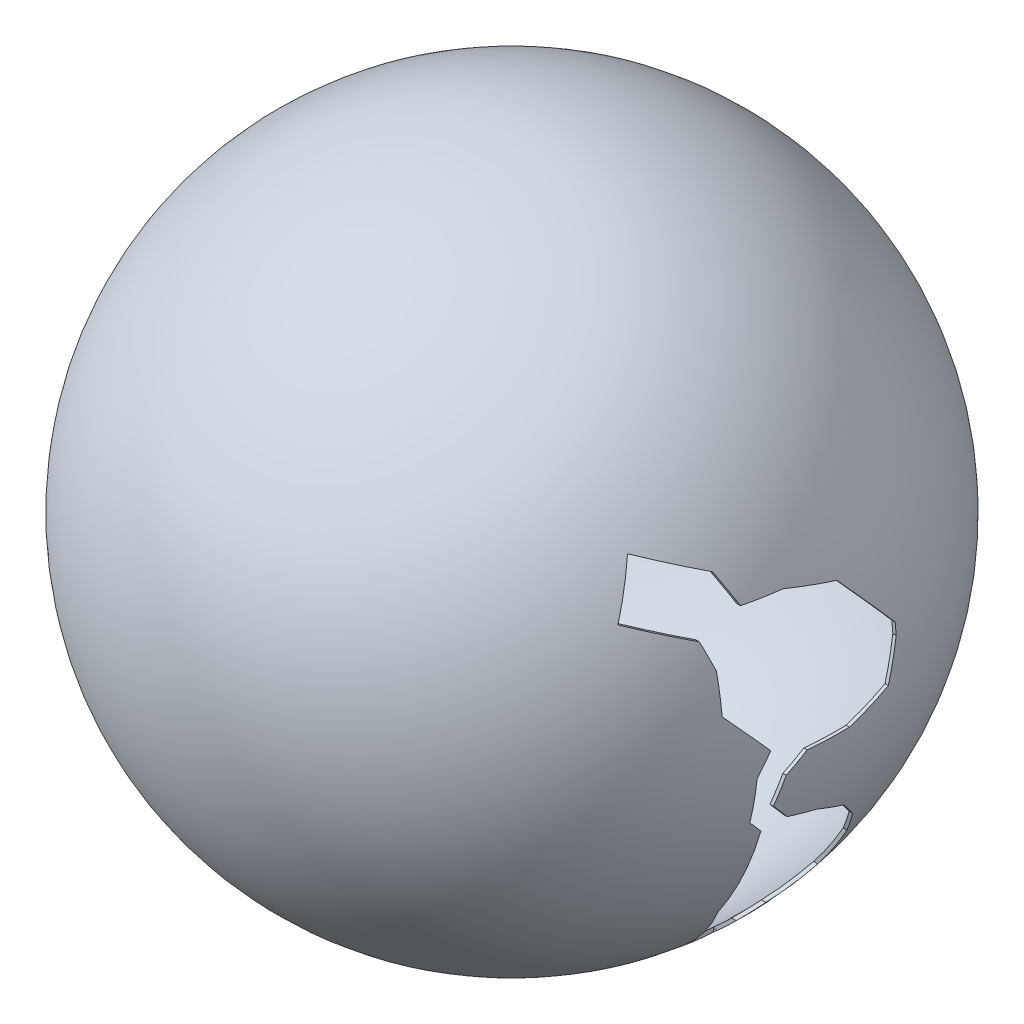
ISO-10303-21;
HEADER;
FILE_DESCRIPTION(('STEP AP214'),'2;1');
FILE_NAME('part.step','',(''),(''),'','','');
FILE_SCHEMA(('AUTOMOTIVE_DESIGN { 1 0 10303 214 1 1 1 1 }'));
ENDSEC;
DATA;
#1=APPLICATION_CONTEXT('core data for automotive mechanical design processes');
#2=APPLICATION_PROTOCOL_DEFINITION('international standard','automotive_design',2000,#1);
#3=PRODUCT_CONTEXT('',#1,'mechanical');
#4=PRODUCT('Part','Part','',(#3));
#5=PRODUCT_RELATED_PRODUCT_CATEGORY('part','',(#4));
#6=PRODUCT_DEFINITION_FORMATION('','',#4);
#7=PRODUCT_DEFINITION_CONTEXT('part definition',#1,'design');
#8=PRODUCT_DEFINITION('design','',#6,#7);
#9=PRODUCT_DEFINITION_SHAPE('','',#8);
#10=(LENGTH_UNIT() NAMED_UNIT(*) SI_UNIT(.MILLI.,.METRE.));
#11=(NAMED_UNIT(*) PLANE_ANGLE_UNIT() SI_UNIT($,.RADIAN.));
#12=(NAMED_UNIT(*) SI_UNIT($,.STERADIAN.) SOLID_ANGLE_UNIT());
#13=UNCERTAINTY_MEASURE_WITH_UNIT(LENGTH_MEASURE(1.E-05),#10,'distance_accuracy_value','');
#14=(GEOMETRIC_REPRESENTATION_CONTEXT(3) GLOBAL_UNCERTAINTY_ASSIGNED_CONTEXT((#13)) GLOBAL_UNIT_ASSIGNED_CONTEXT((#10,
#11,#12)) REPRESENTATION_CONTEXT('',''));
#15=CARTESIAN_POINT('',(0.,0.,0.));
#16=DIRECTION('',(0.,0.,1.));
#17=DIRECTION('',(1.,0.,0.));
#18=AXIS2_PLACEMENT_3D('',#15,#16,#17);
#19=CARTESIAN_POINT('',(0.,0.,0.));
#20=DIRECTION('',(0.,1.,0.));
#21=DIRECTION('',(1.,0.,0.));
#22=AXIS2_PLACEMENT_3D('',#19,#20,#21);
#23=SPHERICAL_SURFACE('',#22,99.);
#24=CARTESIAN_POINT('',(0.,-21.2656708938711,24.1010936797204));
#25=DIRECTION('',(0.,-0.661621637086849,0.749837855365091));
#26=DIRECTION('',(0.,-0.749837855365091,-0.661621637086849));
#27=AXIS2_PLACEMENT_3D('',#24,#25,#26);
#28=CIRCLE('',#27,93.6371108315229);
#29=CARTESIAN_POINT('',(93.6068291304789,-23.051177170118,22.5256469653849));
#30=VERTEX_POINT('',#29);
#31=CARTESIAN_POINT('',(93.3028753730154,-27.1928046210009,18.8712698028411));
#32=VERTEX_POINT('',#31);
#33=EDGE_CURVE('E521',#30,#32,#28,.F.);
#34=ORIENTED_EDGE('',*,*,#33,.T.);
#35=CARTESIAN_POINT('',(0.,0.,18.8712698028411));
#36=DIRECTION('',(0.,0.,1.));
#37=DIRECTION('',(1.,0.,0.));
#38=AXIS2_PLACEMENT_3D('',#35,#36,#37);
#39=CIRCLE('',#38,97.1847476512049);
#40=CARTESIAN_POINT('',(80.0762388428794,-55.0696935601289,18.8712698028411));
#41=VERTEX_POINT('',#40);
#42=EDGE_CURVE('E41',#32,#41,#39,.F.);
#43=ORIENTED_EDGE('',*,*,#42,.T.);
#44=CARTESIAN_POINT('',(0.,-10.6902748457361,33.1729344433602));
#45=DIRECTION('',(0.,-0.306725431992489,0.951798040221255));
#46=DIRECTION('',(0.,-0.951798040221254,-0.306725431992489));
#47=AXIS2_PLACEMENT_3D('',#44,#45,#46);
#48=CIRCLE('',#47,92.6621521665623);
#49=CARTESIAN_POINT('',(64.787557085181,-73.7453461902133,12.8528736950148));
#50=VERTEX_POINT('',#49);
#51=EDGE_CURVE('E439',#41,#50,#48,.F.);
#52=ORIENTED_EDGE('',*,*,#51,.T.);
#53=CARTESIAN_POINT('',(64.787557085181,0.,0.));
#54=DIRECTION('',(-1.,0.,0.));
#55=DIRECTION('',(0.,0.,1.));
#56=AXIS2_PLACEMENT_3D('',#53,#54,#55);
#57=CIRCLE('',#56,74.857013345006);
#58=CARTESIAN_POINT('',(64.787557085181,-74.7767535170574,3.46548414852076));
#59=VERTEX_POINT('',#58);
#60=EDGE_CURVE('E437',#50,#59,#57,.F.);
#61=ORIENTED_EDGE('',*,*,#60,.T.);
#62=CARTESIAN_POINT('',(0.,0.,3.46548414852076));
#63=DIRECTION('',(0.,0.,-1.));
#64=DIRECTION('',(-1.,0.,0.));
#65=AXIS2_PLACEMENT_3D('',#62,#63,#64);
#66=CIRCLE('',#65,98.9393269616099);
#67=CARTESIAN_POINT('',(70.050570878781,-69.870651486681,3.46548414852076));
#68=VERTEX_POINT('',#67);
#69=EDGE_CURVE('E257',#59,#68,#66,.F.);
#70=ORIENTED_EDGE('',*,*,#69,.T.);
#71=CARTESIAN_POINT('',(0.,-37.5659918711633,-33.1464634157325));
#72=DIRECTION('',(0.,-0.749837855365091,-0.661621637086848));
#73=DIRECTION('',(0.,0.661621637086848,-0.749837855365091));
#74=AXIS2_PLACEMENT_3D('',#71,#72,#73);
#75=CIRCLE('',#74,85.3879863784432);
#76=CARTESIAN_POINT('',(74.2174542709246,-65.5023941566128,-1.48520749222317));
#77=VERTEX_POINT('',#76);
#78=EDGE_CURVE('E443',#68,#77,#75,.F.);
#79=ORIENTED_EDGE('',*,*,#78,.T.);
#80=CARTESIAN_POINT('',(0.,-59.7734892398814,-19.2625415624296));
#81=DIRECTION('',(0.,-0.951798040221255,-0.306725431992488));
#82=DIRECTION('',(0.,0.306725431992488,-0.951798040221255));
#83=AXIS2_PLACEMENT_3D('',#80,#81,#82);
#84=CIRCLE('',#83,76.5315913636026);
#85=CARTESIAN_POINT('',(76.4043785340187,-61.1264028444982,-15.0643226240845));
#86=VERTEX_POINT('',#85);
#87=EDGE_CURVE('E446',#77,#86,#84,.F.);
#88=ORIENTED_EDGE('',*,*,#87,.T.);
#89=CARTESIAN_POINT('',(0.,0.,-15.0643226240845));
#90=DIRECTION('',(0.,0.,-1.));
#91=DIRECTION('',(0.,1.,0.));
#92=AXIS2_PLACEMENT_3D('',#89,#90,#91);
#93=CIRCLE('',#92,97.8471572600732);
#94=CARTESIAN_POINT('',(85.3805327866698,-47.7936272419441,-15.0643226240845));
#95=VERTEX_POINT('',#94);
#96=EDGE_CURVE('E449',#86,#95,#93,.F.);
#97=ORIENTED_EDGE('',*,*,#96,.T.);
#98=CARTESIAN_POINT('',(0.,-0.0985595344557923,0.305839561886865));
#99=DIRECTION('',(0.,0.30672543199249,-0.951798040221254));
#100=DIRECTION('',(0.,0.951798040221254,0.30672543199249));
#101=AXIS2_PLACEMENT_3D('',#98,#99,#100);
#102=CIRCLE('',#101,98.999478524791);
#103=CARTESIAN_POINT('',(89.6794168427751,-40.0116964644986,-12.5565258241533));
#104=VERTEX_POINT('',#103);
#105=EDGE_CURVE('E452',#95,#104,#102,.F.);
#106=ORIENTED_EDGE('',*,*,#105,.T.);
#107=CARTESIAN_POINT('',(0.,-11.2854428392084,12.7901685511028));
#108=DIRECTION('',(0.,0.661621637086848,-0.749837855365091));
#109=DIRECTION('',(0.,0.749837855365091,0.661621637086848));
#110=AXIS2_PLACEMENT_3D('',#107,#108,#109);
#111=CIRCLE('',#110,97.5194871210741);
#112=CARTESIAN_POINT('',(93.0893360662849,-33.0749862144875,-6.43589913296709));
#113=VERTEX_POINT('',#112);
#114=EDGE_CURVE('E455',#104,#113,#111,.F.);
#115=ORIENTED_EDGE('',*,*,#114,.T.);
#116=CARTESIAN_POINT('',(0.,-24.5988349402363,11.575922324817));
#117=DIRECTION('',(0.,0.904818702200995,-0.425797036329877));
#118=DIRECTION('',(0.,0.425797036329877,0.904818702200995));
#119=AXIS2_PLACEMENT_3D('',#116,#117,#118);
#120=CIRCLE('',#119,95.1939879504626);
#121=CARTESIAN_POINT('',(94.7710351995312,-28.4155117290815,3.46548414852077));
#122=VERTEX_POINT('',#121);
#123=EDGE_CURVE('E458',#113,#122,#120,.F.);
#124=ORIENTED_EDGE('',*,*,#123,.T.);
#125=CARTESIAN_POINT('',(0.,-27.2944062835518,7.52949138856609));
#126=DIRECTION('',(0.,0.963992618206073,-0.265928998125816));
#127=DIRECTION('',(0.,0.265928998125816,0.963992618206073));
#128=AXIS2_PLACEMENT_3D('',#125,#126,#127);
#129=CIRCLE('',#128,94.8647571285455);
#130=CARTESIAN_POINT('',(94.7339559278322,-25.9700975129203,12.330110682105));
#131=VERTEX_POINT('',#130);
#132=EDGE_CURVE('E461',#122,#131,#129,.F.);
#133=ORIENTED_EDGE('',*,*,#132,.T.);
#134=CARTESIAN_POINT('',(0.,-17.4853116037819,19.816686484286));
#135=DIRECTION('',(0.,0.661621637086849,-0.74983785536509));
#136=DIRECTION('',(0.,0.74983785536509,0.661621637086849));
#137=AXIS2_PLACEMENT_3D('',#134,#135,#136);
#138=CIRCLE('',#137,95.4073519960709);
#139=CARTESIAN_POINT('',(95.317638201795,-20.5870186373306,17.0798861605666));
#140=VERTEX_POINT('',#139);
#141=EDGE_CURVE('E464',#131,#140,#138,.F.);
#142=ORIENTED_EDGE('',*,*,#141,.T.);
#143=CARTESIAN_POINT('',(0.,2.92261259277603,10.594470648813));
#144=DIRECTION('',(0.,-0.265928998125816,-0.963992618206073));
#145=DIRECTION('',(0.,0.963992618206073,-0.265928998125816));
#146=AXIS2_PLACEMENT_3D('',#143,#144,#145);
#147=CIRCLE('',#146,98.3880863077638);
#148=CARTESIAN_POINT('',(97.0508859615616,-12.6613369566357,14.893491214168));
#149=VERTEX_POINT('',#148);
#150=EDGE_CURVE('E467',#140,#149,#147,.F.);
#151=ORIENTED_EDGE('',*,*,#150,.T.);
#152=CARTESIAN_POINT('',(0.,0.269871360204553,0.238121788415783));
#153=DIRECTION('',(0.,-0.749837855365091,-0.661621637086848));
#154=DIRECTION('',(0.,0.661621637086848,-0.749837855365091));
#155=AXIS2_PLACEMENT_3D('',#152,#153,#154);
#156=CIRCLE('',#155,98.9993457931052);
#157=CARTESIAN_POINT('',(98.1997545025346,-8.03812297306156,9.65384869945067));
#158=VERTEX_POINT('',#157);
#159=EDGE_CURVE('E470',#149,#158,#156,.F.);
#160=ORIENTED_EDGE('',*,*,#159,.T.);
#161=CARTESIAN_POINT('',(0.,-8.03812297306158,0.));
#162=DIRECTION('',(0.,-1.,0.));
#163=DIRECTION('',(0.,0.,-1.));
#164=AXIS2_PLACEMENT_3D('',#161,#162,#163);
#165=CIRCLE('',#164,98.6731401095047);
#166=CARTESIAN_POINT('',(98.6355640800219,-8.03812297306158,-2.72288040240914));
#167=VERTEX_POINT('',#166);
#168=EDGE_CURVE('E473',#158,#167,#165,.F.);
#169=ORIENTED_EDGE('',*,*,#168,.T.);
#170=CARTESIAN_POINT('',(0.,-8.07681193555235,-2.60282489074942));
#171=DIRECTION('',(0.,-0.951798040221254,-0.30672543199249));
#172=DIRECTION('',(0.,0.30672543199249,-0.951798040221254));
#173=AXIS2_PLACEMENT_3D('',#170,#171,#172);
#174=CIRCLE('',#173,98.635644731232);
#175=CARTESIAN_POINT('',(97.7115103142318,-3.94510351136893,-15.4239071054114));
#176=VERTEX_POINT('',#175);
#177=EDGE_CURVE('E476',#167,#176,#174,.F.);
#178=ORIENTED_EDGE('',*,*,#177,.T.);
#179=CARTESIAN_POINT('',(0.,-4.2329647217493,-15.3444971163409));
#180=DIRECTION('',(0.,-0.265928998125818,-0.963992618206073));
#181=DIRECTION('',(0.,0.963992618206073,-0.265928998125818));
#182=AXIS2_PLACEMENT_3D('',#179,#180,#181);
#183=CIRCLE('',#182,97.711966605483);
#184=CARTESIAN_POINT('',(96.9756317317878,7.3090211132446,-18.5284932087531));
#185=VERTEX_POINT('',#184);
#186=EDGE_CURVE('E479',#176,#185,#183,.F.);
#187=ORIENTED_EDGE('',*,*,#186,.T.);
#188=CARTESIAN_POINT('',(0.,0.,-18.5284932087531));
#189=DIRECTION('',(0.,0.,-1.));
#190=DIRECTION('',(-1.,0.,0.));
#191=AXIS2_PLACEMENT_3D('',#188,#189,#190);
#192=CIRCLE('',#191,97.250680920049);
#193=CARTESIAN_POINT('',(96.6620286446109,10.6839673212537,-18.5284932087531));
#194=VERTEX_POINT('',#193);
#195=EDGE_CURVE('E482',#185,#194,#192,.F.);
#196=ORIENTED_EDGE('',*,*,#195,.T.);
#197=CARTESIAN_POINT('',(0.,13.868985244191,-15.7181832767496));
#198=DIRECTION('',(0.,0.661621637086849,-0.74983785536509));
#199=DIRECTION('',(0.,0.74983785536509,0.661621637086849));
#200=AXIS2_PLACEMENT_3D('',#197,#198,#199);
#201=CIRCLE('',#200,96.7553097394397);
#202=CARTESIAN_POINT('',(94.7406870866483,28.5969951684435,-2.72288040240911));
#203=VERTEX_POINT('',#202);
#204=EDGE_CURVE('E485',#194,#203,#201,.F.);
#205=ORIENTED_EDGE('',*,*,#204,.T.);
#206=CARTESIAN_POINT('',(0.,27.272686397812,-7.52349969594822));
#207=DIRECTION('',(0.,0.963992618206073,-0.265928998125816));
#208=DIRECTION('',(0.,0.265928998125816,0.963992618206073));
#209=AXIS2_PLACEMENT_3D('',#206,#207,#208);
#210=CIRCLE('',#209,94.8714790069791);
#211=CARTESIAN_POINT('',(92.7666597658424,32.5575484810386,11.6341253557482));
#212=VERTEX_POINT('',#211);
#213=EDGE_CURVE('E488',#203,#212,#210,.F.);
#214=ORIENTED_EDGE('',*,*,#213,.T.);
#215=CARTESIAN_POINT('',(0.,32.5575484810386,0.));
#216=DIRECTION('',(0.,1.,0.));
#217=DIRECTION('',(0.,0.,1.));
#218=AXIS2_PLACEMENT_3D('',#215,#216,#217);
#219=CIRCLE('',#218,93.4933475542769);
#220=CARTESIAN_POINT('',(90.7391936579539,32.5575484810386,22.5256469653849));
#221=VERTEX_POINT('',#220);
#222=EDGE_CURVE('E491',#212,#221,#219,.F.);
#223=ORIENTED_EDGE('',*,*,#222,.T.);
#224=CARTESIAN_POINT('',(0.,-2.91136353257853,6.40604514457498));
#225=DIRECTION('',(0.,0.413746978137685,-0.910391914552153));
#226=DIRECTION('',(0.,0.910391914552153,0.413746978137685));
#227=AXIS2_PLACEMENT_3D('',#224,#225,#226);
#228=CIRCLE('',#227,98.7496154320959);
#229=CARTESIAN_POINT('',(86.0749783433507,41.1518369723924,26.4315042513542));
#230=VERTEX_POINT('',#229);
#231=EDGE_CURVE('E494',#221,#230,#228,.F.);
#232=ORIENTED_EDGE('',*,*,#231,.T.);
#233=CARTESIAN_POINT('',(0.,23.507638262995,-11.0624180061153));
#234=DIRECTION('',(0.,0.904818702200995,-0.425797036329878));
#235=DIRECTION('',(0.,0.425797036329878,0.904818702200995));
#236=AXIS2_PLACEMENT_3D('',#233,#234,#235);
#237=CIRCLE('',#236,95.5301724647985);
#238=CARTESIAN_POINT('',(75.5541816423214,48.3997617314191,41.8333443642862));
#239=VERTEX_POINT('',#238);
#240=EDGE_CURVE('E497',#230,#239,#237,.F.);
#241=ORIENTED_EDGE('',*,*,#240,.T.);
#242=CARTESIAN_POINT('',(0.,24.8921234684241,52.8957623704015));
#243=DIRECTION('',(0.,0.425797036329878,0.904818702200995));
#244=DIRECTION('',(0.,-0.904818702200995,0.425797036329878));
#245=AXIS2_PLACEMENT_3D('',#242,#243,#244);
#246=CIRCLE('',#245,79.8963110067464);
#247=CARTESIAN_POINT('',(79.1604152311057,34.6812906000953,48.2890954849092));
#248=VERTEX_POINT('',#247);
#249=EDGE_CURVE('E500',#239,#248,#246,.F.);
#250=ORIENTED_EDGE('',*,*,#249,.T.);
#251=CARTESIAN_POINT('',(0.,9.78916713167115,-4.60666688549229));
#252=DIRECTION('',(0.,-0.904818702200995,0.425797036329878));
#253=DIRECTION('',(0.,-0.425797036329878,-0.904818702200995));
#254=AXIS2_PLACEMENT_3D('',#251,#252,#253);
#255=CIRCLE('',#254,98.4070669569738);
#256=CARTESIAN_POINT('',(89.0252163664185,27.6445467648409,33.3360148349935));
#257=VERTEX_POINT('',#256);
#258=EDGE_CURVE('E503',#248,#257,#255,.F.);
#259=ORIENTED_EDGE('',*,*,#258,.T.);
#260=CARTESIAN_POINT('',(0.,-7.13132581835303,22.1291788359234));
#261=DIRECTION('',(0.,-0.306725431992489,0.951798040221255));
#262=DIRECTION('',(0.,-0.951798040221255,-0.306725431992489));
#263=AXIS2_PLACEMENT_3D('',#260,#261,#262);
#264=CIRCLE('',#263,96.2311988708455);
#265=CARTESIAN_POINT('',(91.8532661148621,20.1808193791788,30.9307619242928));
#266=VERTEX_POINT('',#265);
#267=EDGE_CURVE('E506',#257,#266,#264,.F.);
#268=ORIENTED_EDGE('',*,*,#267,.T.);
#269=CARTESIAN_POINT('',(0.,0.,30.9307619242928));
#270=DIRECTION('',(0.,0.,1.));
#271=DIRECTION('',(1.,0.,0.));
#272=AXIS2_PLACEMENT_3D('',#269,#270,#271);
#273=CIRCLE('',#272,94.0440745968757);
#274=CARTESIAN_POINT('',(93.6127718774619,8.99649421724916,30.9307619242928));
#275=VERTEX_POINT('',#274);
#276=EDGE_CURVE('E509',#266,#275,#273,.F.);
#277=ORIENTED_EDGE('',*,*,#276,.T.);
#278=CARTESIAN_POINT('',(0.,-11.4068737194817,12.9277902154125));
#279=DIRECTION('',(0.,-0.661621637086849,0.749837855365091));
#280=DIRECTION('',(0.,-0.749837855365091,-0.661621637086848));
#281=AXIS2_PLACEMENT_3D('',#278,#279,#280);
#282=CIRCLE('',#281,97.4872067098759);
#283=CARTESIAN_POINT('',(96.9779847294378,-3.94510351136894,19.5117051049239));
#284=VERTEX_POINT('',#283);
#285=EDGE_CURVE('E512',#275,#284,#282,.F.);
#286=ORIENTED_EDGE('',*,*,#285,.T.);
#287=CARTESIAN_POINT('',(0.,6.80199793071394,14.4542456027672));
#288=DIRECTION('',(0.,0.425797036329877,0.904818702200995));
#289=DIRECTION('',(0.,-0.904818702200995,0.425797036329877));
#290=AXIS2_PLACEMENT_3D('',#287,#288,#289);
#291=CIRCLE('',#290,97.7026489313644);
#292=CARTESIAN_POINT('',(95.8461179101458,-10.3497299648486,22.5256469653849));
#293=VERTEX_POINT('',#292);
#294=EDGE_CURVE('E515',#284,#293,#291,.F.);
#295=ORIENTED_EDGE('',*,*,#294,.T.);
#296=CARTESIAN_POINT('',(0.,0.,22.5256469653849));
#297=DIRECTION('',(0.,0.,1.));
#298=DIRECTION('',(1.,0.,0.));
#299=AXIS2_PLACEMENT_3D('',#296,#297,#298);
#300=CIRCLE('',#299,96.4032946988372);
#301=EDGE_CURVE('E518',#293,#30,#300,.F.);
#302=ORIENTED_EDGE('',*,*,#301,.T.);
#303=EDGE_LOOP('',(#34,#43,#52,#61,#70,#79,#88,#97,#106,#115,#124,#133,#142,#151,#160,#169,#178,
#187,#196,#205,#214,#223,#232,#241,#250,#259,#268,#277,#286,#295,#302));
#304=FACE_BOUND('',#303,.T.);
#305=ADVANCED_FACE('F33',(#304),#23,.F.);
#306=CARTESIAN_POINT('',(64.787557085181,-75.367529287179,3.46548414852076));
#307=DIRECTION('',(0.,-0.425797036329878,-0.904818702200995));
#308=DIRECTION('',(0.,0.904818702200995,-0.425797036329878));
#309=AXIS2_PLACEMENT_3D('',#306,#307,#308);
#310=PLANE('',#309);
#311=DIRECTION('',(1.,0.,0.));
#312=VECTOR('',#311,1.);
#313=CARTESIAN_POINT('',(64.787557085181,-75.367529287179,3.46548414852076));
#314=LINE('',#313,#312);
#315=CARTESIAN_POINT('',(64.787557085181,-75.367529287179,3.46548414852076));
#316=VERTEX_POINT('',#315);
#317=CARTESIAN_POINT('',(65.6332686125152,-75.367529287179,3.46548414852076));
#318=VERTEX_POINT('',#317);
#319=EDGE_CURVE('E247',#316,#318,#314,.T.);
#320=ORIENTED_EDGE('',*,*,#319,.F.);
#321=DIRECTION('',(0.,0.904818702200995,-0.425797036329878));
#322=VECTOR('',#321,1.);
#323=CARTESIAN_POINT('',(64.787557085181,-75.367529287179,3.46548414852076));
#324=LINE('',#323,#322);
#325=CARTESIAN_POINT('',(64.787557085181,-76.0797446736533,3.80064433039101));
#326=VERTEX_POINT('',#325);
#327=EDGE_CURVE('E239',#326,#316,#324,.T.);
#328=ORIENTED_EDGE('',*,*,#327,.F.);
#329=CARTESIAN_POINT('',(0.,-12.3292238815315,-26.1996007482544));
#330=DIRECTION('',(0.,-0.425797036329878,-0.904818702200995));
#331=DIRECTION('',(0.,0.904818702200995,-0.425797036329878));
#332=AXIS2_PLACEMENT_3D('',#329,#330,#331);
#333=CIRCLE('',#332,95.7160966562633);
#334=EDGE_CURVE('E11',#318,#326,#333,.T.);
#335=ORIENTED_EDGE('',*,*,#334,.F.);
#336=EDGE_LOOP('',(#320,#328,#335));
#337=FACE_BOUND('',#336,.T.);
#338=ADVANCED_FACE('F248',(#337),#310,.F.);
#339=CARTESIAN_POINT('',(64.787557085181,48.3997617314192,41.8333443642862));
#340=DIRECTION('',(0.,0.904818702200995,-0.425797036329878));
#341=DIRECTION('',(0.,0.425797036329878,0.904818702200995));
#342=AXIS2_PLACEMENT_3D('',#339,#340,#341);
#343=PLANE('',#342);
#344=DIRECTION('',(1.,0.,0.));
#345=VECTOR('',#344,1.);
#346=CARTESIAN_POINT('',(64.787557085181,48.3997617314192,41.8333443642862));
#347=LINE('',#346,#345);
#348=CARTESIAN_POINT('',(76.8598358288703,48.3997617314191,41.8333443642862));
#349=VERTEX_POINT('',#348);
#350=EDGE_CURVE('E266',#239,#349,#347,.T.);
#351=ORIENTED_EDGE('',*,*,#350,.F.);
#352=ORIENTED_EDGE('',*,*,#240,.F.);
#353=DIRECTION('',(1.,0.,0.));
#354=VECTOR('',#353,1.);
#355=CARTESIAN_POINT('',(64.787557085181,41.1518369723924,26.4315042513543));
#356=LINE('',#355,#354);
#357=CARTESIAN_POINT('',(87.2232875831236,41.1518369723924,26.4315042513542));
#358=VERTEX_POINT('',#357);
#359=EDGE_CURVE('E269',#230,#358,#356,.T.);
#360=ORIENTED_EDGE('',*,*,#359,.T.);
#361=CARTESIAN_POINT('',(0.,23.507638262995,-11.0624180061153));
#362=DIRECTION('',(0.,0.904818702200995,-0.425797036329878));
#363=DIRECTION('',(0.,0.425797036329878,0.904818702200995));
#364=AXIS2_PLACEMENT_3D('',#361,#362,#363);
#365=CIRCLE('',#364,96.5661112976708);
#366=EDGE_CURVE('E434',#349,#358,#365,.T.);
#367=ORIENTED_EDGE('',*,*,#366,.F.);
#368=EDGE_LOOP('',(#351,#352,#360,#367));
#369=FACE_BOUND('',#368,.T.);
#370=ADVANCED_FACE('F591',(#369),#343,.F.);
#371=CARTESIAN_POINT('',(64.787557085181,41.1518369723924,26.4315042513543));
#372=DIRECTION('',(0.,0.413746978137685,-0.910391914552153));
#373=DIRECTION('',(0.,0.910391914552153,0.413746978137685));
#374=AXIS2_PLACEMENT_3D('',#371,#372,#373);
#375=PLANE('',#374);
#376=ORIENTED_EDGE('',*,*,#359,.F.);
#377=ORIENTED_EDGE('',*,*,#231,.F.);
#378=DIRECTION('',(1.,0.,0.));
#379=VECTOR('',#378,1.);
#380=CARTESIAN_POINT('',(64.787557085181,32.5575484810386,22.5256469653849));
#381=LINE('',#380,#379);
#382=CARTESIAN_POINT('',(91.829196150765,32.5575484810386,22.5256469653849));
#383=VERTEX_POINT('',#382);
#384=EDGE_CURVE('E272',#221,#383,#381,.T.);
#385=ORIENTED_EDGE('',*,*,#384,.T.);
#386=CARTESIAN_POINT('',(0.,-2.91136353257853,6.40604514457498));
#387=DIRECTION('',(0.,0.413746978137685,-0.910391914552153));
#388=DIRECTION('',(0.,0.910391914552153,0.413746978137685));
#389=AXIS2_PLACEMENT_3D('',#386,#387,#388);
#390=CIRCLE('',#389,99.7521255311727);
#391=EDGE_CURVE('E431',#358,#383,#390,.T.);
#392=ORIENTED_EDGE('',*,*,#391,.F.);
#393=EDGE_LOOP('',(#376,#377,#385,#392));
#394=FACE_BOUND('',#393,.T.);
#395=ADVANCED_FACE('F588',(#394),#375,.F.);
#396=CARTESIAN_POINT('',(64.787557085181,32.5575484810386,22.5256469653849));
#397=DIRECTION('',(0.,1.,0.));
#398=DIRECTION('',(0.,0.,1.));
#399=AXIS2_PLACEMENT_3D('',#396,#397,#398);
#400=PLANE('',#399);
#401=ORIENTED_EDGE('',*,*,#384,.F.);
#402=ORIENTED_EDGE('',*,*,#222,.F.);
#403=DIRECTION('',(1.,0.,0.));
#404=VECTOR('',#403,1.);
#405=CARTESIAN_POINT('',(64.787557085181,32.5575484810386,11.6341253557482));
#406=LINE('',#405,#404);
#407=CARTESIAN_POINT('',(93.8331133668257,32.5575484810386,11.6341253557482));
#408=VERTEX_POINT('',#407);
#409=EDGE_CURVE('E275',#212,#408,#406,.T.);
#410=ORIENTED_EDGE('',*,*,#409,.T.);
#411=CARTESIAN_POINT('',(0.,32.5575484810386,0.));
#412=DIRECTION('',(0.,1.,0.));
#413=DIRECTION('',(0.,0.,1.));
#414=AXIS2_PLACEMENT_3D('',#411,#412,#413);
#415=CIRCLE('',#414,94.5516051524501);
#416=EDGE_CURVE('E428',#383,#408,#415,.T.);
#417=ORIENTED_EDGE('',*,*,#416,.F.);
#418=EDGE_LOOP('',(#401,#402,#410,#417));
#419=FACE_BOUND('',#418,.T.);
#420=ADVANCED_FACE('F585',(#419),#400,.F.);
#421=CARTESIAN_POINT('',(64.787557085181,32.5575484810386,11.6341253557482));
#422=DIRECTION('',(0.,0.963992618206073,-0.265928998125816));
#423=DIRECTION('',(0.,0.265928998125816,0.963992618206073));
#424=AXIS2_PLACEMENT_3D('',#421,#422,#423);
#425=PLANE('',#424);
#426=ORIENTED_EDGE('',*,*,#409,.F.);
#427=ORIENTED_EDGE('',*,*,#213,.F.);
#428=DIRECTION('',(1.,0.,0.));
#429=VECTOR('',#428,1.);
#430=CARTESIAN_POINT('',(64.787557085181,28.5969951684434,-2.72288040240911));
#431=LINE('',#430,#429);
#432=CARTESIAN_POINT('',(95.7851647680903,28.5969951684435,-2.72288040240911));
#433=VERTEX_POINT('',#432);
#434=EDGE_CURVE('E278',#203,#433,#431,.T.);
#435=ORIENTED_EDGE('',*,*,#434,.T.);
#436=CARTESIAN_POINT('',(0.,27.272686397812,-7.52349969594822));
#437=DIRECTION('',(0.,0.963992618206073,-0.265928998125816));
#438=DIRECTION('',(0.,0.265928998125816,0.963992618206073));
#439=AXIS2_PLACEMENT_3D('',#436,#437,#438);
#440=CIRCLE('',#439,95.9145324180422);
#441=EDGE_CURVE('E425',#408,#433,#440,.T.);
#442=ORIENTED_EDGE('',*,*,#441,.F.);
#443=EDGE_LOOP('',(#426,#427,#435,#442));
#444=FACE_BOUND('',#443,.T.);
#445=ADVANCED_FACE('F582',(#444),#425,.F.);
#446=CARTESIAN_POINT('',(64.787557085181,28.5969951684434,-2.72288040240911));
#447=DIRECTION('',(0.,0.661621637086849,-0.74983785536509));
#448=DIRECTION('',(0.,0.74983785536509,0.661621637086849));
#449=AXIS2_PLACEMENT_3D('',#446,#447,#448);
#450=PLANE('',#449);
#451=ORIENTED_EDGE('',*,*,#434,.F.);
#452=ORIENTED_EDGE('',*,*,#204,.F.);
#453=DIRECTION('',(1.,0.,0.));
#454=VECTOR('',#453,1.);
#455=CARTESIAN_POINT('',(64.787557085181,10.6839673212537,-18.5284932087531));
#456=LINE('',#455,#454);
#457=CARTESIAN_POINT('',(97.6859651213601,10.6839673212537,-18.5284932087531));
#458=VERTEX_POINT('',#457);
#459=EDGE_CURVE('E281',#194,#458,#456,.T.);
#460=ORIENTED_EDGE('',*,*,#459,.T.);
#461=CARTESIAN_POINT('',(0.,13.868985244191,-15.7181832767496));
#462=DIRECTION('',(0.,0.661621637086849,-0.74983785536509));
#463=DIRECTION('',(0.,0.74983785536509,0.661621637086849));
#464=AXIS2_PLACEMENT_3D('',#461,#462,#463);
#465=CIRCLE('',#464,97.7782693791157);
#466=EDGE_CURVE('E422',#433,#458,#465,.T.);
#467=ORIENTED_EDGE('',*,*,#466,.F.);
#468=EDGE_LOOP('',(#451,#452,#460,#467));
#469=FACE_BOUND('',#468,.T.);
#470=ADVANCED_FACE('F579',(#469),#450,.F.);
#471=CARTESIAN_POINT('',(64.787557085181,10.6839673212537,-18.5284932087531));
#472=DIRECTION('',(0.,0.,-1.));
#473=DIRECTION('',(-1.,0.,0.));
#474=AXIS2_PLACEMENT_3D('',#471,#472,#473);
#475=PLANE('',#474);
#476=ORIENTED_EDGE('',*,*,#459,.F.);
#477=ORIENTED_EDGE('',*,*,#195,.F.);
#478=DIRECTION('',(1.,0.,0.));
#479=VECTOR('',#478,1.);
#480=CARTESIAN_POINT('',(64.787557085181,7.3090211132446,-18.5284932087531));
#481=LINE('',#480,#479);
#482=CARTESIAN_POINT('',(97.996291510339,7.3090211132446,-18.5284932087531));
#483=VERTEX_POINT('',#482);
#484=EDGE_CURVE('E284',#185,#483,#481,.T.);
#485=ORIENTED_EDGE('',*,*,#484,.T.);
#486=CARTESIAN_POINT('',(0.,0.,-18.5284932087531));
#487=DIRECTION('',(0.,0.,-1.));
#488=DIRECTION('',(-1.,0.,0.));
#489=AXIS2_PLACEMENT_3D('',#486,#487,#488);
#490=CIRCLE('',#489,98.2684839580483);
#491=EDGE_CURVE('E419',#458,#483,#490,.T.);
#492=ORIENTED_EDGE('',*,*,#491,.F.);
#493=EDGE_LOOP('',(#476,#477,#485,#492));
#494=FACE_BOUND('',#493,.T.);
#495=ADVANCED_FACE('F576',(#494),#475,.F.);
#496=CARTESIAN_POINT('',(64.787557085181,7.3090211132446,-18.5284932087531));
#497=DIRECTION('',(0.,-0.265928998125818,-0.963992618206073));
#498=DIRECTION('',(0.,0.963992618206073,-0.265928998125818));
#499=AXIS2_PLACEMENT_3D('',#496,#497,#498);
#500=PLANE('',#499);
#501=ORIENTED_EDGE('',*,*,#484,.F.);
#502=ORIENTED_EDGE('',*,*,#186,.F.);
#503=DIRECTION('',(1.,0.,0.));
#504=VECTOR('',#503,1.);
#505=CARTESIAN_POINT('',(64.787557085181,-3.94510351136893,-15.4239071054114));
#506=LINE('',#505,#504);
#507=CARTESIAN_POINT('',(98.7245625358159,-3.94510351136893,-15.4239071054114));
#508=VERTEX_POINT('',#507);
#509=EDGE_CURVE('E287',#176,#508,#506,.T.);
#510=ORIENTED_EDGE('',*,*,#509,.T.);
#511=CARTESIAN_POINT('',(0.,-4.2329647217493,-15.3444971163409));
#512=DIRECTION('',(0.,-0.265928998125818,-0.963992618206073));
#513=DIRECTION('',(0.,0.963992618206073,-0.265928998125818));
#514=AXIS2_PLACEMENT_3D('',#511,#512,#513);
#515=CIRCLE('',#514,98.7250141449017);
#516=EDGE_CURVE('E416',#483,#508,#515,.T.);
#517=ORIENTED_EDGE('',*,*,#516,.F.);
#518=EDGE_LOOP('',(#501,#502,#510,#517));
#519=FACE_BOUND('',#518,.T.);
#520=ADVANCED_FACE('F573',(#519),#500,.F.);
#521=CARTESIAN_POINT('',(64.787557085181,-3.94510351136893,-15.4239071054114));
#522=DIRECTION('',(0.,-0.951798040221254,-0.30672543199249));
#523=DIRECTION('',(0.,0.30672543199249,-0.951798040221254));
#524=AXIS2_PLACEMENT_3D('',#521,#522,#523);
#525=PLANE('',#524);
#526=ORIENTED_EDGE('',*,*,#509,.F.);
#527=ORIENTED_EDGE('',*,*,#177,.F.);
#528=DIRECTION('',(1.,0.,0.));
#529=VECTOR('',#528,1.);
#530=CARTESIAN_POINT('',(64.787557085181,-8.03812297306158,-2.72288040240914));
#531=LINE('',#530,#529);
#532=CARTESIAN_POINT('',(99.6392217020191,-8.03812297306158,-2.72288040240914));
#533=VERTEX_POINT('',#532);
#534=EDGE_CURVE('E290',#167,#533,#531,.T.);
#535=ORIENTED_EDGE('',*,*,#534,.T.);
#536=CARTESIAN_POINT('',(0.,-8.07681193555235,-2.60282489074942));
#537=DIRECTION('',(0.,-0.951798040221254,-0.30672543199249));
#538=DIRECTION('',(0.,0.30672543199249,-0.951798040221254));
#539=AXIS2_PLACEMENT_3D('',#536,#537,#538);
#540=CIRCLE('',#539,99.6393015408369);
#541=EDGE_CURVE('E413',#508,#533,#540,.T.);
#542=ORIENTED_EDGE('',*,*,#541,.F.);
#543=EDGE_LOOP('',(#526,#527,#535,#542));
#544=FACE_BOUND('',#543,.T.);
#545=ADVANCED_FACE('F570',(#544),#525,.F.);
#546=CARTESIAN_POINT('',(64.787557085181,-8.03812297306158,-2.72288040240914));
#547=DIRECTION('',(0.,-1.,0.));
#548=DIRECTION('',(0.,0.,-1.));
#549=AXIS2_PLACEMENT_3D('',#546,#547,#548);
#550=PLANE('',#549);
#551=ORIENTED_EDGE('',*,*,#534,.F.);
#552=ORIENTED_EDGE('',*,*,#168,.F.);
#553=DIRECTION('',(1.,0.,0.));
#554=VECTOR('',#553,1.);
#555=CARTESIAN_POINT('',(64.787557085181,-8.03812297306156,9.65384869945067));
#556=LINE('',#555,#554);
#557=CARTESIAN_POINT('',(99.2078211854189,-8.03812297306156,9.65384869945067));
#558=VERTEX_POINT('',#557);
#559=EDGE_CURVE('E293',#158,#558,#556,.T.);
#560=ORIENTED_EDGE('',*,*,#559,.T.);
#561=CARTESIAN_POINT('',(0.,-8.03812297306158,0.));
#562=DIRECTION('',(0.,-1.,0.));
#563=DIRECTION('',(0.,0.,-1.));
#564=AXIS2_PLACEMENT_3D('',#561,#562,#563);
#565=CIRCLE('',#564,99.6764193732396);
#566=EDGE_CURVE('E410',#533,#558,#565,.T.);
#567=ORIENTED_EDGE('',*,*,#566,.F.);
#568=EDGE_LOOP('',(#551,#552,#560,#567));
#569=FACE_BOUND('',#568,.T.);
#570=ADVANCED_FACE('F567',(#569),#550,.F.);
#571=CARTESIAN_POINT('',(64.787557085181,-8.03812297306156,9.65384869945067));
#572=DIRECTION('',(0.,-0.749837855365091,-0.661621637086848));
#573=DIRECTION('',(0.,0.661621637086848,-0.749837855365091));
#574=AXIS2_PLACEMENT_3D('',#571,#572,#573);
#575=PLANE('',#574);
#576=ORIENTED_EDGE('',*,*,#559,.F.);
#577=ORIENTED_EDGE('',*,*,#159,.F.);
#578=DIRECTION('',(1.,0.,0.));
#579=VECTOR('',#578,1.);
#580=CARTESIAN_POINT('',(64.787557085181,-12.6613369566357,14.893491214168));
#581=LINE('',#580,#579);
#582=CARTESIAN_POINT('',(98.0707625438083,-12.6613369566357,14.893491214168));
#583=VERTEX_POINT('',#582);
#584=EDGE_CURVE('E296',#149,#583,#581,.T.);
#585=ORIENTED_EDGE('',*,*,#584,.T.);
#586=CARTESIAN_POINT('',(0.,0.269871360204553,0.238121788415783));
#587=DIRECTION('',(0.,-0.749837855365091,-0.661621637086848));
#588=DIRECTION('',(0.,0.661621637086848,-0.749837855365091));
#589=AXIS2_PLACEMENT_3D('',#586,#587,#588);
#590=CIRCLE('',#589,99.9993523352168);
#591=EDGE_CURVE('E407',#558,#583,#590,.T.);
#592=ORIENTED_EDGE('',*,*,#591,.F.);
#593=EDGE_LOOP('',(#576,#577,#585,#592));
#594=FACE_BOUND('',#593,.T.);
#595=ADVANCED_FACE('F564',(#594),#575,.F.);
#596=CARTESIAN_POINT('',(64.787557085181,-12.6613369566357,14.893491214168));
#597=DIRECTION('',(0.,-0.265928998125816,-0.963992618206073));
#598=DIRECTION('',(0.,0.963992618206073,-0.265928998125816));
#599=AXIS2_PLACEMENT_3D('',#596,#597,#598);
#600=PLANE('',#599);
#601=ORIENTED_EDGE('',*,*,#584,.F.);
#602=ORIENTED_EDGE('',*,*,#150,.F.);
#603=DIRECTION('',(1.,0.,0.));
#604=VECTOR('',#603,1.);
#605=CARTESIAN_POINT('',(64.787557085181,-20.5870186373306,17.0798861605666));
#606=LINE('',#605,#604);
#607=CARTESIAN_POINT('',(96.3558620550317,-20.5870186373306,17.0798861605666));
#608=VERTEX_POINT('',#607);
#609=EDGE_CURVE('E299',#140,#608,#606,.T.);
#610=ORIENTED_EDGE('',*,*,#609,.T.);
#611=CARTESIAN_POINT('',(0.,2.92261259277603,10.594470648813));
#612=DIRECTION('',(0.,-0.265928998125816,-0.963992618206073));
#613=DIRECTION('',(0.,0.963992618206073,-0.265928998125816));
#614=AXIS2_PLACEMENT_3D('',#611,#612,#613);
#615=CIRCLE('',#614,99.3942429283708);
#616=EDGE_CURVE('E404',#583,#608,#615,.T.);
#617=ORIENTED_EDGE('',*,*,#616,.F.);
#618=EDGE_LOOP('',(#601,#602,#610,#617));
#619=FACE_BOUND('',#618,.T.);
#620=ADVANCED_FACE('F561',(#619),#600,.F.);
#621=CARTESIAN_POINT('',(64.787557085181,-20.5870186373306,17.0798861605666));
#622=DIRECTION('',(0.,0.661621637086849,-0.74983785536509));
#623=DIRECTION('',(0.,0.74983785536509,0.661621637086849));
#624=AXIS2_PLACEMENT_3D('',#621,#622,#623);
#625=PLANE('',#624);
#626=ORIENTED_EDGE('',*,*,#609,.F.);
#627=ORIENTED_EDGE('',*,*,#141,.F.);
#628=DIRECTION('',(1.,0.,0.));
#629=VECTOR('',#628,1.);
#630=CARTESIAN_POINT('',(64.787557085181,-25.9700975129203,12.330110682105));
#631=LINE('',#630,#629);
#632=CARTESIAN_POINT('',(95.7785070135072,-25.9700975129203,12.330110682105));
#633=VERTEX_POINT('',#632);
#634=EDGE_CURVE('E302',#131,#633,#631,.T.);
#635=ORIENTED_EDGE('',*,*,#634,.T.);
#636=CARTESIAN_POINT('',(0.,-17.4853116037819,19.816686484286));
#637=DIRECTION('',(0.,0.661621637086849,-0.74983785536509));
#638=DIRECTION('',(0.,0.74983785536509,0.661621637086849));
#639=AXIS2_PLACEMENT_3D('',#636,#637,#638);
#640=CIRCLE('',#639,96.4446100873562);
#641=EDGE_CURVE('E401',#608,#633,#640,.T.);
#642=ORIENTED_EDGE('',*,*,#641,.F.);
#643=EDGE_LOOP('',(#626,#627,#635,#642));
#644=FACE_BOUND('',#643,.T.);
#645=ADVANCED_FACE('F558',(#644),#625,.F.);
#646=CARTESIAN_POINT('',(64.787557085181,-25.9700975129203,12.330110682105));
#647=DIRECTION('',(0.,0.963992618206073,-0.265928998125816));
#648=DIRECTION('',(0.,0.265928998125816,0.963992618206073));
#649=AXIS2_PLACEMENT_3D('',#646,#647,#648);
#650=PLANE('',#649);
#651=ORIENTED_EDGE('',*,*,#634,.F.);
#652=ORIENTED_EDGE('',*,*,#132,.F.);
#653=DIRECTION('',(1.,0.,0.));
#654=VECTOR('',#653,1.);
#655=CARTESIAN_POINT('',(64.787557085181,-28.4155117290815,3.46548414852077));
#656=LINE('',#655,#654);
#657=CARTESIAN_POINT('',(95.8151820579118,-28.4155117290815,3.46548414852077));
#658=VERTEX_POINT('',#657);
#659=EDGE_CURVE('E305',#122,#658,#656,.T.);
#660=ORIENTED_EDGE('',*,*,#659,.T.);
#661=CARTESIAN_POINT('',(0.,-27.2944062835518,7.52949138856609));
#662=DIRECTION('',(0.,0.963992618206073,-0.265928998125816));
#663=DIRECTION('',(0.,0.265928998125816,0.963992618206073));
#664=AXIS2_PLACEMENT_3D('',#661,#662,#663);
#665=CIRCLE('',#664,95.9078836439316);
#666=EDGE_CURVE('E398',#633,#658,#665,.T.);
#667=ORIENTED_EDGE('',*,*,#666,.F.);
#668=EDGE_LOOP('',(#651,#652,#660,#667));
#669=FACE_BOUND('',#668,.T.);
#670=ADVANCED_FACE('F555',(#669),#650,.F.);
#671=CARTESIAN_POINT('',(64.787557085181,-28.4155117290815,3.46548414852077));
#672=DIRECTION('',(0.,0.904818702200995,-0.425797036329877));
#673=DIRECTION('',(0.,0.425797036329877,0.904818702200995));
#674=AXIS2_PLACEMENT_3D('',#671,#672,#673);
#675=PLANE('',#674);
#676=ORIENTED_EDGE('',*,*,#659,.F.);
#677=ORIENTED_EDGE('',*,*,#123,.F.);
#678=DIRECTION('',(1.,0.,0.));
#679=VECTOR('',#678,1.);
#680=CARTESIAN_POINT('',(64.787557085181,-33.0749862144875,-6.43589913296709));
#681=LINE('',#680,#679);
#682=CARTESIAN_POINT('',(94.1521348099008,-33.0749862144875,-6.43589913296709));
#683=VERTEX_POINT('',#682);
#684=EDGE_CURVE('E308',#113,#683,#681,.T.);
#685=ORIENTED_EDGE('',*,*,#684,.T.);
#686=CARTESIAN_POINT('',(0.,-24.5988349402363,11.575922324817));
#687=DIRECTION('',(0.,0.904818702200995,-0.425797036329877));
#688=DIRECTION('',(0.,0.425797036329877,0.904818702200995));
#689=AXIS2_PLACEMENT_3D('',#686,#687,#688);
#690=CIRCLE('',#689,96.2335458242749);
#691=EDGE_CURVE('E395',#658,#683,#690,.T.);
#692=ORIENTED_EDGE('',*,*,#691,.F.);
#693=EDGE_LOOP('',(#676,#677,#685,#692));
#694=FACE_BOUND('',#693,.T.);
#695=ADVANCED_FACE('F552',(#694),#675,.F.);
#696=CARTESIAN_POINT('',(64.787557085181,-33.0749862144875,-6.43589913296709));
#697=DIRECTION('',(0.,0.661621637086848,-0.749837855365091));
#698=DIRECTION('',(0.,0.749837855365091,0.661621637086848));
#699=AXIS2_PLACEMENT_3D('',#696,#697,#698);
#700=PLANE('',#699);
#701=ORIENTED_EDGE('',*,*,#684,.F.);
#702=ORIENTED_EDGE('',*,*,#114,.F.);
#703=DIRECTION('',(1.,0.,0.));
#704=VECTOR('',#703,1.);
#705=CARTESIAN_POINT('',(64.787557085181,-40.0116964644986,-12.5565258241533));
#706=LINE('',#705,#704);
#707=CARTESIAN_POINT('',(90.7821447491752,-40.0116964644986,-12.5565258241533));
#708=VERTEX_POINT('',#707);
#709=EDGE_CURVE('E311',#104,#708,#706,.T.);
#710=ORIENTED_EDGE('',*,*,#709,.T.);
#711=CARTESIAN_POINT('',(0.,-11.2854428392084,12.7901685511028));
#712=DIRECTION('',(0.,0.661621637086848,-0.749837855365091));
#713=DIRECTION('',(0.,0.749837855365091,0.661621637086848));
#714=AXIS2_PLACEMENT_3D('',#711,#712,#713);
#715=CIRCLE('',#714,98.5345135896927);
#716=EDGE_CURVE('E392',#683,#708,#715,.T.);
#717=ORIENTED_EDGE('',*,*,#716,.F.);
#718=EDGE_LOOP('',(#701,#702,#710,#717));
#719=FACE_BOUND('',#718,.T.);
#720=ADVANCED_FACE('F549',(#719),#700,.F.);
#721=CARTESIAN_POINT('',(64.787557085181,-40.0116964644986,-12.5565258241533));
#722=DIRECTION('',(0.,0.30672543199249,-0.951798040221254));
#723=DIRECTION('',(0.,0.951798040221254,0.30672543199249));
#724=AXIS2_PLACEMENT_3D('',#721,#722,#723);
#725=PLANE('',#724);
#726=ORIENTED_EDGE('',*,*,#709,.F.);
#727=ORIENTED_EDGE('',*,*,#105,.F.);
#728=DIRECTION('',(1.,0.,0.));
#729=VECTOR('',#728,1.);
#730=CARTESIAN_POINT('',(64.787557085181,-47.7936272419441,-15.0643226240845));
#731=LINE('',#730,#729);
#732=CARTESIAN_POINT('',(86.5380574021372,-47.7936272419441,-15.0643226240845));
#733=VERTEX_POINT('',#732);
#734=EDGE_CURVE('E314',#95,#733,#731,.T.);
#735=ORIENTED_EDGE('',*,*,#734,.T.);
#736=CARTESIAN_POINT('',(0.,-0.0985595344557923,0.305839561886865));
#737=DIRECTION('',(0.,0.30672543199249,-0.951798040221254));
#738=DIRECTION('',(0.,0.951798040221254,0.30672543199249));
#739=AXIS2_PLACEMENT_3D('',#736,#737,#738);
#740=CIRCLE('',#739,99.9994837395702);
#741=EDGE_CURVE('E389',#708,#733,#740,.T.);
#742=ORIENTED_EDGE('',*,*,#741,.F.);
#743=EDGE_LOOP('',(#726,#727,#735,#742));
#744=FACE_BOUND('',#743,.T.);
#745=ADVANCED_FACE('F546',(#744),#725,.F.);
#746=CARTESIAN_POINT('',(64.787557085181,-47.7936272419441,-15.0643226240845));
#747=DIRECTION('',(0.,0.,-1.));
#748=DIRECTION('',(0.,1.,0.));
#749=AXIS2_PLACEMENT_3D('',#746,#747,#748);
#750=PLANE('',#749);
#751=ORIENTED_EDGE('',*,*,#734,.F.);
#752=ORIENTED_EDGE('',*,*,#96,.F.);
#753=DIRECTION('',(1.,0.,0.));
#754=VECTOR('',#753,1.);
#755=CARTESIAN_POINT('',(64.787557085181,-61.1264028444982,-15.0643226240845));
#756=LINE('',#755,#754);
#757=CARTESIAN_POINT('',(77.6957467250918,-61.1264028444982,-15.0643226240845));
#758=VERTEX_POINT('',#757);
#759=EDGE_CURVE('E317',#86,#758,#756,.T.);
#760=ORIENTED_EDGE('',*,*,#759,.T.);
#761=CARTESIAN_POINT('',(0.,0.,-15.0643226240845));
#762=DIRECTION('',(0.,0.,-1.));
#763=DIRECTION('',(0.,1.,0.));
#764=AXIS2_PLACEMENT_3D('',#761,#762,#763);
#765=CIRCLE('',#764,98.8588194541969);
#766=EDGE_CURVE('E386',#733,#758,#765,.T.);
#767=ORIENTED_EDGE('',*,*,#766,.F.);
#768=EDGE_LOOP('',(#751,#752,#760,#767));
#769=FACE_BOUND('',#768,.T.);
#770=ADVANCED_FACE('F543',(#769),#750,.F.);
#771=CARTESIAN_POINT('',(64.787557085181,-61.1264028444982,-15.0643226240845));
#772=DIRECTION('',(0.,-0.951798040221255,-0.306725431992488));
#773=DIRECTION('',(0.,0.306725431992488,-0.951798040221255));
#774=AXIS2_PLACEMENT_3D('',#771,#772,#773);
#775=PLANE('',#774);
#776=ORIENTED_EDGE('',*,*,#759,.F.);
#777=ORIENTED_EDGE('',*,*,#87,.F.);
#778=DIRECTION('',(1.,0.,0.));
#779=VECTOR('',#778,1.);
#780=CARTESIAN_POINT('',(64.787557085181,-65.5023941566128,-1.48520749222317));
#781=LINE('',#780,#779);
#782=CARTESIAN_POINT('',(75.5462144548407,-65.5023941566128,-1.48520749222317));
#783=VERTEX_POINT('',#782);
#784=EDGE_CURVE('E320',#77,#783,#781,.T.);
#785=ORIENTED_EDGE('',*,*,#784,.T.);
#786=CARTESIAN_POINT('',(0.,-59.7734892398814,-19.2625415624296));
#787=DIRECTION('',(0.,-0.951798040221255,-0.306725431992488));
#788=DIRECTION('',(0.,0.306725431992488,-0.951798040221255));
#789=AXIS2_PLACEMENT_3D('',#786,#787,#788);
#790=CIRCLE('',#789,77.8208485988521);
#791=EDGE_CURVE('E383',#758,#783,#790,.T.);
#792=ORIENTED_EDGE('',*,*,#791,.F.);
#793=EDGE_LOOP('',(#776,#777,#785,#792));
#794=FACE_BOUND('',#793,.T.);
#795=ADVANCED_FACE('F540',(#794),#775,.F.);
#796=CARTESIAN_POINT('',(64.787557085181,-65.5023941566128,-1.48520749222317));
#797=DIRECTION('',(0.,-0.749837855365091,-0.661621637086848));
#798=DIRECTION('',(0.,0.661621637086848,-0.749837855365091));
#799=AXIS2_PLACEMENT_3D('',#796,#797,#798);
#800=PLANE('',#799);
#801=ORIENTED_EDGE('',*,*,#784,.F.);
#802=ORIENTED_EDGE('',*,*,#78,.F.);
#803=DIRECTION('',(1.,0.,0.));
#804=VECTOR('',#803,1.);
#805=CARTESIAN_POINT('',(64.787557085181,-69.870651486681,3.46548414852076));
#806=LINE('',#805,#804);
#807=CARTESIAN_POINT('',(71.4568574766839,-69.870651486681,3.46548414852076));
#808=VERTEX_POINT('',#807);
#809=EDGE_CURVE('E251',#68,#808,#806,.T.);
#810=ORIENTED_EDGE('',*,*,#809,.T.);
#811=CARTESIAN_POINT('',(0.,-37.5659918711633,-33.1464634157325));
#812=DIRECTION('',(0.,-0.749837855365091,-0.661621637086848));
#813=DIRECTION('',(0.,0.661621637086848,-0.749837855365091));
#814=AXIS2_PLACEMENT_3D('',#811,#812,#813);
#815=CIRCLE('',#814,86.545411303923);
#816=EDGE_CURVE('E380',#783,#808,#815,.T.);
#817=ORIENTED_EDGE('',*,*,#816,.F.);
#818=EDGE_LOOP('',(#801,#802,#810,#817));
#819=FACE_BOUND('',#818,.T.);
#820=ADVANCED_FACE('F537',(#819),#800,.F.);
#821=CARTESIAN_POINT('',(64.787557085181,-69.870651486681,3.46548414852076));
#822=DIRECTION('',(0.,0.,-1.));
#823=DIRECTION('',(-1.,0.,0.));
#824=AXIS2_PLACEMENT_3D('',#821,#822,#823);
#825=PLANE('',#824);
#826=ORIENTED_EDGE('',*,*,#809,.F.);
#827=ORIENTED_EDGE('',*,*,#69,.F.);
#828=DIRECTION('',(0.,1.,0.));
#829=VECTOR('',#828,1.);
#830=CARTESIAN_POINT('',(64.787557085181,-69.870651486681,3.46548414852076));
#831=LINE('',#830,#829);
#832=EDGE_CURVE('E54',#316,#59,#831,.T.);
#833=ORIENTED_EDGE('',*,*,#832,.F.);
#834=ORIENTED_EDGE('',*,*,#319,.T.);
#835=CARTESIAN_POINT('',(0.,0.,3.46548414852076));
#836=DIRECTION('',(0.,0.,-1.));
#837=DIRECTION('',(-1.,0.,0.));
#838=AXIS2_PLACEMENT_3D('',#835,#836,#837);
#839=CIRCLE('',#838,99.9399340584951);
#840=EDGE_CURVE('E378',#808,#318,#839,.T.);
#841=ORIENTED_EDGE('',*,*,#840,.F.);
#842=EDGE_LOOP('',(#826,#827,#833,#834,#841));
#843=FACE_BOUND('',#842,.T.);
#844=ADVANCED_FACE('F255',(#843),#825,.F.);
#845=CARTESIAN_POINT('',(64.787557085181,-75.367529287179,12.330110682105));
#846=DIRECTION('',(0.,-0.306725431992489,0.951798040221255));
#847=DIRECTION('',(0.,-0.951798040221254,-0.306725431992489));
#848=AXIS2_PLACEMENT_3D('',#845,#846,#847);
#849=PLANE('',#848);
#850=DIRECTION('',(0.,-0.951798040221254,-0.306725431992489));
#851=VECTOR('',#850,1.);
#852=CARTESIAN_POINT('',(64.787557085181,-67.998027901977,14.7049984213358));
#853=LINE('',#852,#851);
#854=CARTESIAN_POINT('',(64.787557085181,-75.1590270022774,12.3973024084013));
#855=VERTEX_POINT('',#854);
#856=EDGE_CURVE('E48',#50,#855,#853,.T.);
#857=ORIENTED_EDGE('',*,*,#856,.F.);
#858=ORIENTED_EDGE('',*,*,#51,.F.);
#859=DIRECTION('',(1.,0.,0.));
#860=VECTOR('',#859,1.);
#861=CARTESIAN_POINT('',(64.787557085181,-55.0696935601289,18.8712698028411));
#862=LINE('',#861,#860);
#863=CARTESIAN_POINT('',(81.3093108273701,-55.0696935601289,18.8712698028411));
#864=VERTEX_POINT('',#863);
#865=EDGE_CURVE('E252',#41,#864,#862,.T.);
#866=ORIENTED_EDGE('',*,*,#865,.T.);
#867=CARTESIAN_POINT('',(0.,-10.6902748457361,33.1729344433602));
#868=DIRECTION('',(0.,-0.306725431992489,0.951798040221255));
#869=DIRECTION('',(0.,-0.951798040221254,-0.306725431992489));
#870=AXIS2_PLACEMENT_3D('',#867,#868,#869);
#871=CIRCLE('',#870,93.7297948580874);
#872=EDGE_CURVE('E375',#855,#864,#871,.T.);
#873=ORIENTED_EDGE('',*,*,#872,.F.);
#874=EDGE_LOOP('',(#857,#858,#866,#873));
#875=FACE_BOUND('',#874,.T.);
#876=ADVANCED_FACE('F534',(#875),#849,.F.);
#877=CARTESIAN_POINT('',(64.787557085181,-55.0696935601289,18.8712698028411));
#878=DIRECTION('',(0.,0.,1.));
#879=DIRECTION('',(1.,0.,0.));
#880=AXIS2_PLACEMENT_3D('',#877,#878,#879);
#881=PLANE('',#880);
#882=ORIENTED_EDGE('',*,*,#865,.F.);
#883=ORIENTED_EDGE('',*,*,#42,.F.);
#884=DIRECTION('',(1.,0.,0.));
#885=VECTOR('',#884,1.);
#886=CARTESIAN_POINT('',(64.787557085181,-27.1928046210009,18.8712698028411));
#887=LINE('',#886,#885);
#888=CARTESIAN_POINT('',(94.3632690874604,-27.1928046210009,18.8712698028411));
#889=VERTEX_POINT('',#888);
#890=EDGE_CURVE('E327',#32,#889,#887,.T.);
#891=ORIENTED_EDGE('',*,*,#890,.T.);
#892=CARTESIAN_POINT('',(0.,0.,18.8712698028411));
#893=DIRECTION('',(0.,0.,1.));
#894=DIRECTION('',(1.,0.,0.));
#895=AXIS2_PLACEMENT_3D('',#892,#893,#894);
#896=CIRCLE('',#895,98.2032340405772);
#897=EDGE_CURVE('E372',#864,#889,#896,.T.);
#898=ORIENTED_EDGE('',*,*,#897,.F.);
#899=EDGE_LOOP('',(#882,#883,#891,#898));
#900=FACE_BOUND('',#899,.T.);
#901=ADVANCED_FACE('F528',(#900),#881,.F.);
#902=CARTESIAN_POINT('',(64.787557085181,-27.1928046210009,18.8712698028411));
#903=DIRECTION('',(0.,-0.661621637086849,0.749837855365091));
#904=DIRECTION('',(0.,-0.749837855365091,-0.661621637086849));
#905=AXIS2_PLACEMENT_3D('',#902,#903,#904);
#906=PLANE('',#905);
#907=ORIENTED_EDGE('',*,*,#890,.F.);
#908=ORIENTED_EDGE('',*,*,#33,.F.);
#909=DIRECTION('',(1.,0.,0.));
#910=VECTOR('',#909,1.);
#911=CARTESIAN_POINT('',(64.787557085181,-23.051177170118,22.5256469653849));
#912=LINE('',#911,#910);
#913=CARTESIAN_POINT('',(94.6638181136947,-23.051177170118,22.5256469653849));
#914=VERTEX_POINT('',#913);
#915=EDGE_CURVE('E330',#30,#914,#912,.T.);
#916=ORIENTED_EDGE('',*,*,#915,.T.);
#917=CARTESIAN_POINT('',(0.,-21.2656708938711,24.1010936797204));
#918=DIRECTION('',(0.,-0.661621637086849,0.749837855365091));
#919=DIRECTION('',(0.,-0.749837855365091,-0.661621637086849));
#920=AXIS2_PLACEMENT_3D('',#917,#918,#919);
#921=CIRCLE('',#920,94.6937618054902);
#922=EDGE_CURVE('E369',#889,#914,#921,.T.);
#923=ORIENTED_EDGE('',*,*,#922,.F.);
#924=EDGE_LOOP('',(#907,#908,#916,#923));
#925=FACE_BOUND('',#924,.T.);
#926=ADVANCED_FACE('F530',(#925),#906,.F.);
#927=CARTESIAN_POINT('',(64.787557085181,-23.051177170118,22.5256469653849));
#928=DIRECTION('',(0.,0.,1.));
#929=DIRECTION('',(1.,0.,0.));
#930=AXIS2_PLACEMENT_3D('',#927,#928,#929);
#931=PLANE('',#930);
#932=ORIENTED_EDGE('',*,*,#915,.F.);
#933=ORIENTED_EDGE('',*,*,#301,.F.);
#934=DIRECTION('',(1.,0.,0.));
#935=VECTOR('',#934,1.);
#936=CARTESIAN_POINT('',(64.787557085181,-10.3497299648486,22.5256469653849));
#937=LINE('',#936,#935);
#938=CARTESIAN_POINT('',(96.87867834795,-10.3497299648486,22.5256469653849));
#939=VERTEX_POINT('',#938);
#940=EDGE_CURVE('E333',#293,#939,#937,.T.);
#941=ORIENTED_EDGE('',*,*,#940,.T.);
#942=CARTESIAN_POINT('',(0.,0.,22.5256469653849));
#943=DIRECTION('',(0.,0.,1.));
#944=DIRECTION('',(1.,0.,0.));
#945=AXIS2_PLACEMENT_3D('',#942,#943,#944);
#946=CIRCLE('',#945,97.4299503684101);
#947=EDGE_CURVE('E366',#914,#939,#946,.T.);
#948=ORIENTED_EDGE('',*,*,#947,.F.);
#949=EDGE_LOOP('',(#932,#933,#941,#948));
#950=FACE_BOUND('',#949,.T.);
#951=ADVANCED_FACE('F611',(#950),#931,.F.);
#952=CARTESIAN_POINT('',(64.787557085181,-10.3497299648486,22.5256469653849));
#953=DIRECTION('',(0.,0.425797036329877,0.904818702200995));
#954=DIRECTION('',(0.,-0.904818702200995,0.425797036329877));
#955=AXIS2_PLACEMENT_3D('',#952,#953,#954);
#956=PLANE('',#955);
#957=ORIENTED_EDGE('',*,*,#940,.F.);
#958=ORIENTED_EDGE('',*,*,#294,.F.);
#959=DIRECTION('',(1.,0.,0.));
#960=VECTOR('',#959,1.);
#961=CARTESIAN_POINT('',(64.787557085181,-3.94510351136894,19.5117051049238));
#962=LINE('',#961,#960);
#963=CARTESIAN_POINT('',(97.9986200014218,-3.94510351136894,19.5117051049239));
#964=VERTEX_POINT('',#963);
#965=EDGE_CURVE('E336',#284,#964,#962,.T.);
#966=ORIENTED_EDGE('',*,*,#965,.T.);
#967=CARTESIAN_POINT('',(0.,6.80199793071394,14.4542456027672));
#968=DIRECTION('',(0.,0.425797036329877,0.904818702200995));
#969=DIRECTION('',(0.,-0.904818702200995,0.425797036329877));
#970=AXIS2_PLACEMENT_3D('',#967,#968,#969);
#971=CIRCLE('',#970,98.7157920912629);
#972=EDGE_CURVE('E363',#939,#964,#971,.T.);
#973=ORIENTED_EDGE('',*,*,#972,.F.);
#974=EDGE_LOOP('',(#957,#958,#966,#973));
#975=FACE_BOUND('',#974,.T.);
#976=ADVANCED_FACE('F609',(#975),#956,.F.);
#977=CARTESIAN_POINT('',(64.787557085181,-3.94510351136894,19.5117051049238));
#978=DIRECTION('',(0.,-0.661621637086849,0.749837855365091));
#979=DIRECTION('',(0.,-0.749837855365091,-0.661621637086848));
#980=AXIS2_PLACEMENT_3D('',#977,#978,#979);
#981=PLANE('',#980);
#982=ORIENTED_EDGE('',*,*,#965,.F.);
#983=ORIENTED_EDGE('',*,*,#285,.F.);
#984=DIRECTION('',(1.,0.,0.));
#985=VECTOR('',#984,1.);
#986=CARTESIAN_POINT('',(64.787557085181,8.99649421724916,30.9307619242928));
#987=LINE('',#986,#985);
#988=CARTESIAN_POINT('',(94.6696945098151,8.99649421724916,30.9307619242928));
#989=VERTEX_POINT('',#988);
#990=EDGE_CURVE('E339',#275,#989,#987,.T.);
#991=ORIENTED_EDGE('',*,*,#990,.T.);
#992=CARTESIAN_POINT('',(0.,-11.4068737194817,12.9277902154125));
#993=DIRECTION('',(0.,-0.661621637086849,0.749837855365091));
#994=DIRECTION('',(0.,-0.749837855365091,-0.661621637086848));
#995=AXIS2_PLACEMENT_3D('',#992,#993,#994);
#996=CIRCLE('',#995,98.502565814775);
#997=EDGE_CURVE('E360',#964,#989,#996,.T.);
#998=ORIENTED_EDGE('',*,*,#997,.F.);
#999=EDGE_LOOP('',(#982,#983,#991,#998));
#1000=FACE_BOUND('',#999,.T.);
#1001=ADVANCED_FACE('F606',(#1000),#981,.F.);
#1002=CARTESIAN_POINT('',(64.787557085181,8.99649421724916,30.9307619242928));
#1003=DIRECTION('',(0.,0.,1.));
#1004=DIRECTION('',(1.,0.,0.));
#1005=AXIS2_PLACEMENT_3D('',#1002,#1003,#1004);
#1006=PLANE('',#1005);
#1007=ORIENTED_EDGE('',*,*,#990,.F.);
#1008=ORIENTED_EDGE('',*,*,#276,.F.);
#1009=DIRECTION('',(1.,0.,0.));
#1010=VECTOR('',#1009,1.);
#1011=CARTESIAN_POINT('',(64.787557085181,20.1808193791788,30.9307619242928));
#1012=LINE('',#1011,#1010);
#1013=CARTESIAN_POINT('',(92.930202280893,20.1808193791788,30.9307619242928));
#1014=VERTEX_POINT('',#1013);
#1015=EDGE_CURVE('E342',#266,#1014,#1012,.T.);
#1016=ORIENTED_EDGE('',*,*,#1015,.T.);
#1017=CARTESIAN_POINT('',(0.,0.,30.9307619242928));
#1018=DIRECTION('',(0.,0.,1.));
#1019=DIRECTION('',(1.,0.,0.));
#1020=AXIS2_PLACEMENT_3D('',#1017,#1018,#1019);
#1021=CIRCLE('',#1020,95.0962037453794);
#1022=EDGE_CURVE('E357',#989,#1014,#1021,.T.);
#1023=ORIENTED_EDGE('',*,*,#1022,.F.);
#1024=EDGE_LOOP('',(#1007,#1008,#1016,#1023));
#1025=FACE_BOUND('',#1024,.T.);
#1026=ADVANCED_FACE('F603',(#1025),#1006,.F.);
#1027=CARTESIAN_POINT('',(64.787557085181,20.1808193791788,30.9307619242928));
#1028=DIRECTION('',(0.,-0.306725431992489,0.951798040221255));
#1029=DIRECTION('',(0.,-0.951798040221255,-0.306725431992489));
#1030=AXIS2_PLACEMENT_3D('',#1027,#1028,#1029);
#1031=PLANE('',#1030);
#1032=ORIENTED_EDGE('',*,*,#1015,.F.);
#1033=ORIENTED_EDGE('',*,*,#267,.F.);
#1034=DIRECTION('',(1.,0.,0.));
#1035=VECTOR('',#1034,1.);
#1036=CARTESIAN_POINT('',(64.787557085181,27.6445467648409,33.3360148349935));
#1037=LINE('',#1036,#1035);
#1038=CARTESIAN_POINT('',(90.1359481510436,27.6445467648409,33.3360148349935));
#1039=VERTEX_POINT('',#1038);
#1040=EDGE_CURVE('E262',#257,#1039,#1037,.T.);
#1041=ORIENTED_EDGE('',*,*,#1040,.T.);
#1042=CARTESIAN_POINT('',(0.,-7.13132581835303,22.1291788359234));
#1043=DIRECTION('',(0.,-0.306725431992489,0.951798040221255));
#1044=DIRECTION('',(0.,-0.951798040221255,-0.306725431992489));
#1045=AXIS2_PLACEMENT_3D('',#1042,#1043,#1044);
#1046=CIRCLE('',#1045,97.2596711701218);
#1047=EDGE_CURVE('E354',#1014,#1039,#1046,.T.);
#1048=ORIENTED_EDGE('',*,*,#1047,.F.);
#1049=EDGE_LOOP('',(#1032,#1033,#1041,#1048));
#1050=FACE_BOUND('',#1049,.T.);
#1051=ADVANCED_FACE('F600',(#1050),#1031,.F.);
#1052=CARTESIAN_POINT('',(64.787557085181,27.6445467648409,33.3360148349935));
#1053=DIRECTION('',(0.,-0.904818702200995,0.425797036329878));
#1054=DIRECTION('',(0.,-0.425797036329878,-0.904818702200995));
#1055=AXIS2_PLACEMENT_3D('',#1052,#1053,#1054);
#1056=PLANE('',#1055);
#1057=ORIENTED_EDGE('',*,*,#1040,.F.);
#1058=ORIENTED_EDGE('',*,*,#258,.F.);
#1059=DIRECTION('',(1.,0.,0.));
#1060=VECTOR('',#1059,1.);
#1061=CARTESIAN_POINT('',(64.787557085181,34.6812906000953,48.2890954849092));
#1062=LINE('',#1061,#1060);
#1063=CARTESIAN_POINT('',(80.4075328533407,34.6812906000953,48.2890954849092));
#1064=VERTEX_POINT('',#1063);
#1065=EDGE_CURVE('E259',#248,#1064,#1062,.T.);
#1066=ORIENTED_EDGE('',*,*,#1065,.T.);
#1067=CARTESIAN_POINT('',(0.,9.78916713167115,-4.60666688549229));
#1068=DIRECTION('',(0.,-0.904818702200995,0.425797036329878));
#1069=DIRECTION('',(0.,-0.425797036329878,-0.904818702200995));
#1070=AXIS2_PLACEMENT_3D('',#1067,#1068,#1069);
#1071=CIRCLE('',#1070,99.4130314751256);
#1072=EDGE_CURVE('E351',#1039,#1064,#1071,.T.);
#1073=ORIENTED_EDGE('',*,*,#1072,.F.);
#1074=EDGE_LOOP('',(#1057,#1058,#1066,#1073));
#1075=FACE_BOUND('',#1074,.T.);
#1076=ADVANCED_FACE('F597',(#1075),#1056,.F.);
#1077=CARTESIAN_POINT('',(64.787557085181,34.6812906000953,48.2890954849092));
#1078=DIRECTION('',(0.,0.425797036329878,0.904818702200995));
#1079=DIRECTION('',(0.,-0.904818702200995,0.425797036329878));
#1080=AXIS2_PLACEMENT_3D('',#1077,#1078,#1079);
#1081=PLANE('',#1080);
#1082=ORIENTED_EDGE('',*,*,#1065,.F.);
#1083=ORIENTED_EDGE('',*,*,#249,.F.);
#1084=ORIENTED_EDGE('',*,*,#350,.T.);
#1085=CARTESIAN_POINT('',(0.,24.8921234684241,52.8957623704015));
#1086=DIRECTION('',(0.,0.425797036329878,0.904818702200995));
#1087=DIRECTION('',(0.,-0.904818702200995,0.425797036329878));
#1088=AXIS2_PLACEMENT_3D('',#1085,#1086,#1087);
#1089=CIRCLE('',#1088,81.1321176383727);
#1090=EDGE_CURVE('E348',#1064,#349,#1089,.T.);
#1091=ORIENTED_EDGE('',*,*,#1090,.F.);
#1092=EDGE_LOOP('',(#1082,#1083,#1084,#1091));
#1093=FACE_BOUND('',#1092,.T.);
#1094=ADVANCED_FACE('F594',(#1093),#1081,.F.);
#1095=CARTESIAN_POINT('',(64.787557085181,48.3997617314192,41.8333443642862));
#1096=DIRECTION('',(-1.,0.,0.));
#1097=DIRECTION('',(0.,0.,1.));
#1098=AXIS2_PLACEMENT_3D('',#1095,#1096,#1097);
#1099=PLANE('',#1098);
#1100=ORIENTED_EDGE('',*,*,#327,.T.);
#1101=ORIENTED_EDGE('',*,*,#832,.T.);
#1102=ORIENTED_EDGE('',*,*,#60,.F.);
#1103=ORIENTED_EDGE('',*,*,#856,.T.);
#1104=CARTESIAN_POINT('',(64.787557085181,0.,0.));
#1105=DIRECTION('',(-1.,0.,0.));
#1106=DIRECTION('',(0.,0.,1.));
#1107=AXIS2_PLACEMENT_3D('',#1104,#1105,#1106);
#1108=CIRCLE('',#1107,76.1746181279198);
#1109=EDGE_CURVE('E243',#326,#855,#1108,.T.);
#1110=ORIENTED_EDGE('',*,*,#1109,.F.);
#1111=EDGE_LOOP('',(#1100,#1101,#1102,#1103,#1110));
#1112=FACE_BOUND('',#1111,.T.);
#1113=ADVANCED_FACE('F241',(#1112),#1099,.F.);
#1114=CARTESIAN_POINT('',(0.,0.,0.));
#1115=DIRECTION('',(0.,1.,0.));
#1116=DIRECTION('',(1.,0.,0.));
#1117=AXIS2_PLACEMENT_3D('',#1114,#1115,#1116);
#1118=SPHERICAL_SURFACE('',#1117,100.);
#1119=ORIENTED_EDGE('',*,*,#872,.T.);
#1120=ORIENTED_EDGE('',*,*,#897,.T.);
#1121=ORIENTED_EDGE('',*,*,#922,.T.);
#1122=ORIENTED_EDGE('',*,*,#947,.T.);
#1123=ORIENTED_EDGE('',*,*,#972,.T.);
#1124=ORIENTED_EDGE('',*,*,#997,.T.);
#1125=ORIENTED_EDGE('',*,*,#1022,.T.);
#1126=ORIENTED_EDGE('',*,*,#1047,.T.);
#1127=ORIENTED_EDGE('',*,*,#1072,.T.);
#1128=ORIENTED_EDGE('',*,*,#1090,.T.);
#1129=ORIENTED_EDGE('',*,*,#366,.T.);
#1130=ORIENTED_EDGE('',*,*,#391,.T.);
#1131=ORIENTED_EDGE('',*,*,#416,.T.);
#1132=ORIENTED_EDGE('',*,*,#441,.T.);
#1133=ORIENTED_EDGE('',*,*,#466,.T.);
#1134=ORIENTED_EDGE('',*,*,#491,.T.);
#1135=ORIENTED_EDGE('',*,*,#516,.T.);
#1136=ORIENTED_EDGE('',*,*,#541,.T.);
#1137=ORIENTED_EDGE('',*,*,#566,.T.);
#1138=ORIENTED_EDGE('',*,*,#591,.T.);
#1139=ORIENTED_EDGE('',*,*,#616,.T.);
#1140=ORIENTED_EDGE('',*,*,#641,.T.);
#1141=ORIENTED_EDGE('',*,*,#666,.T.);
#1142=ORIENTED_EDGE('',*,*,#691,.T.);
#1143=ORIENTED_EDGE('',*,*,#716,.T.);
#1144=ORIENTED_EDGE('',*,*,#741,.T.);
#1145=ORIENTED_EDGE('',*,*,#766,.T.);
#1146=ORIENTED_EDGE('',*,*,#791,.T.);
#1147=ORIENTED_EDGE('',*,*,#816,.T.);
#1148=ORIENTED_EDGE('',*,*,#840,.T.);
#1149=ORIENTED_EDGE('',*,*,#334,.T.);
#1150=ORIENTED_EDGE('',*,*,#1109,.T.);
#1151=EDGE_LOOP('',(#1119,#1120,#1121,#1122,#1123,#1124,#1125,#1126,#1127,#1128,#1129,#1130,
#1131,#1132,#1133,#1134,#1135,#1136,#1137,#1138,#1139,#1140,#1141,#1142,#1143,#1144,#1145,#1146,
#1147,#1148,#1149,#1150));
#1152=FACE_BOUND('',#1151,.T.);
#1153=ADVANCED_FACE('F35',(#1152),#1118,.T.);
#1154=CLOSED_SHELL('',(#305,#338,#370,#395,#420,#445,#470,#495,#520,#545,#570,#595,#620,#645,
#670,#695,#720,#745,#770,#795,#820,#844,#876,#901,#926,#951,#976,#1001,#1026,#1051,#1076,#1094,
#1113,#1153));
#1155=MANIFOLD_SOLID_BREP('B2',#1154);
#1156=ADVANCED_BREP_SHAPE_REPRESENTATION('',(#18,#1155),#14);
#1157=SHAPE_DEFINITION_REPRESENTATION(#9,#1156);
ENDSEC;
END-ISO-10303-21;
